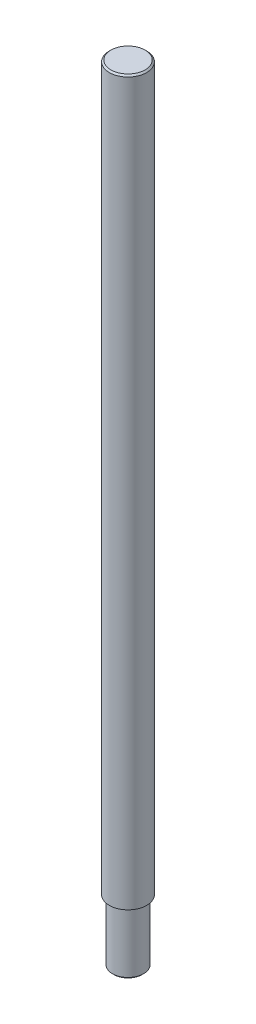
ISO-10303-21;
HEADER;
FILE_DESCRIPTION(('STEP AP214'),'2;1');
FILE_NAME('part.step','',(''),(''),'','','');
FILE_SCHEMA(('AUTOMOTIVE_DESIGN { 1 0 10303 214 1 1 1 1 }'));
ENDSEC;
DATA;
#1=APPLICATION_CONTEXT('core data for automotive mechanical design processes');
#2=APPLICATION_PROTOCOL_DEFINITION('international standard','automotive_design',2000,#1);
#3=PRODUCT_CONTEXT('',#1,'mechanical');
#4=PRODUCT('Part','Part','',(#3));
#5=PRODUCT_RELATED_PRODUCT_CATEGORY('part','',(#4));
#6=PRODUCT_DEFINITION_FORMATION('','',#4);
#7=PRODUCT_DEFINITION_CONTEXT('part definition',#1,'design');
#8=PRODUCT_DEFINITION('design','',#6,#7);
#9=PRODUCT_DEFINITION_SHAPE('','',#8);
#10=(LENGTH_UNIT() NAMED_UNIT(*) SI_UNIT(.MILLI.,.METRE.));
#11=(NAMED_UNIT(*) PLANE_ANGLE_UNIT() SI_UNIT($,.RADIAN.));
#12=(NAMED_UNIT(*) SI_UNIT($,.STERADIAN.) SOLID_ANGLE_UNIT());
#13=UNCERTAINTY_MEASURE_WITH_UNIT(LENGTH_MEASURE(1.E-05),#10,'distance_accuracy_value','');
#14=(GEOMETRIC_REPRESENTATION_CONTEXT(3) GLOBAL_UNCERTAINTY_ASSIGNED_CONTEXT((#13)) GLOBAL_UNIT_ASSIGNED_CONTEXT((#10,
#11,#12)) REPRESENTATION_CONTEXT('',''));
#15=CARTESIAN_POINT('',(0.,0.,0.));
#16=DIRECTION('',(0.,0.,1.));
#17=DIRECTION('',(1.,0.,0.));
#18=AXIS2_PLACEMENT_3D('',#15,#16,#17);
#19=CARTESIAN_POINT('',(0.,-10.,0.));
#20=DIRECTION('',(0.,1.,0.));
#21=DIRECTION('',(0.,0.,1.));
#22=AXIS2_PLACEMENT_3D('',#19,#20,#21);
#23=CYLINDRICAL_SURFACE('',#22,2.5);
#24=CARTESIAN_POINT('',(0.,-9.75,0.));
#25=DIRECTION('',(0.,1.,0.));
#26=DIRECTION('',(0.,0.,1.));
#27=AXIS2_PLACEMENT_3D('',#24,#25,#26);
#28=CIRCLE('',#27,2.5);
#29=CARTESIAN_POINT('',(0.,-9.75,2.5));
#30=VERTEX_POINT('',#29);
#31=EDGE_CURVE('E9178',#30,#30,#28,.T.);
#32=ORIENTED_EDGE('',*,*,#31,.T.);
#33=EDGE_LOOP('',(#32));
#34=FACE_BOUND('',#33,.T.);
#35=CARTESIAN_POINT('',(0.,0.,0.));
#36=DIRECTION('',(0.,1.,0.));
#37=DIRECTION('',(0.,0.,1.));
#38=AXIS2_PLACEMENT_3D('',#35,#36,#37);
#39=CIRCLE('',#38,2.5);
#40=CARTESIAN_POINT('',(0.,0.,2.5));
#41=VERTEX_POINT('',#40);
#42=EDGE_CURVE('E9191',#41,#41,#39,.T.);
#43=ORIENTED_EDGE('',*,*,#42,.F.);
#44=EDGE_LOOP('',(#43));
#45=FACE_BOUND('',#44,.T.);
#46=ADVANCED_FACE('F9172',(#34,#45),#23,.T.);
#47=CARTESIAN_POINT('',(0.,-10.,0.));
#48=DIRECTION('',(0.,1.,0.));
#49=DIRECTION('',(0.,0.,1.));
#50=AXIS2_PLACEMENT_3D('',#47,#48,#49);
#51=PLANE('',#50);
#52=CARTESIAN_POINT('',(0.,-10.,0.));
#53=DIRECTION('',(0.,1.,0.));
#54=DIRECTION('',(0.,0.,1.));
#55=AXIS2_PLACEMENT_3D('',#52,#53,#54);
#56=CIRCLE('',#55,2.25);
#57=CARTESIAN_POINT('',(0.,-10.,2.25));
#58=VERTEX_POINT('',#57);
#59=EDGE_CURVE('E10',#58,#58,#56,.F.);
#60=ORIENTED_EDGE('',*,*,#59,.T.);
#61=EDGE_LOOP('',(#60));
#62=FACE_BOUND('',#61,.T.);
#63=ADVANCED_FACE('F9217',(#62),#51,.F.);
#64=CARTESIAN_POINT('',(0.,116.,0.));
#65=DIRECTION('',(0.,-1.,0.));
#66=DIRECTION('',(0.,0.,-1.));
#67=AXIS2_PLACEMENT_3D('',#64,#65,#66);
#68=CYLINDRICAL_SURFACE('',#67,3.);
#69=CARTESIAN_POINT('',(0.,115.75,0.));
#70=DIRECTION('',(0.,1.,0.));
#71=DIRECTION('',(0.,0.,1.));
#72=AXIS2_PLACEMENT_3D('',#69,#70,#71);
#73=CIRCLE('',#72,3.);
#74=CARTESIAN_POINT('',(0.,115.75,-3.));
#75=VERTEX_POINT('',#74);
#76=EDGE_CURVE('E9182',#75,#75,#73,.F.);
#77=CARTESIAN_POINT('',(0.,0.,0.));
#78=DIRECTION('',(0.,1.,0.));
#79=DIRECTION('',(0.,0.,1.));
#80=AXIS2_PLACEMENT_3D('',#77,#78,#79);
#81=CIRCLE('',#80,3.);
#82=CARTESIAN_POINT('',(0.,0.,-3.));
#83=VERTEX_POINT('',#82);
#84=EDGE_CURVE('E9194',#83,#83,#81,.T.);
#85=CARTESIAN_POINT('',(0.,115.75,-3.));
#86=CARTESIAN_POINT('',(0.,114.544270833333,-3.));
#87=CARTESIAN_POINT('',(0.,113.338541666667,-3.));
#88=CARTESIAN_POINT('',(0.,110.927083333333,-3.));
#89=CARTESIAN_POINT('',(0.,109.721354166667,-3.));
#90=CARTESIAN_POINT('',(0.,107.309895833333,-3.));
#91=CARTESIAN_POINT('',(0.,106.104166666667,-3.));
#92=CARTESIAN_POINT('',(0.,103.692708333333,-3.));
#93=CARTESIAN_POINT('',(0.,102.486979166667,-3.));
#94=CARTESIAN_POINT('',(0.,100.075520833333,-3.));
#95=CARTESIAN_POINT('',(0.,98.8697916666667,-3.));
#96=CARTESIAN_POINT('',(0.,96.4583333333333,-3.));
#97=CARTESIAN_POINT('',(0.,95.2526041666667,-3.));
#98=CARTESIAN_POINT('',(0.,92.8411458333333,-3.));
#99=CARTESIAN_POINT('',(0.,91.6354166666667,-3.));
#100=CARTESIAN_POINT('',(0.,89.2239583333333,-3.));
#101=CARTESIAN_POINT('',(0.,88.0182291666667,-3.));
#102=CARTESIAN_POINT('',(0.,85.6067708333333,-3.));
#103=CARTESIAN_POINT('',(0.,84.4010416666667,-3.));
#104=CARTESIAN_POINT('',(0.,81.9895833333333,-3.));
#105=CARTESIAN_POINT('',(0.,80.7838541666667,-3.));
#106=CARTESIAN_POINT('',(0.,78.3723958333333,-3.));
#107=CARTESIAN_POINT('',(0.,77.1666666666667,-3.));
#108=CARTESIAN_POINT('',(0.,74.7552083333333,-3.));
#109=CARTESIAN_POINT('',(0.,73.5494791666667,-3.));
#110=CARTESIAN_POINT('',(0.,71.1380208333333,-3.));
#111=CARTESIAN_POINT('',(0.,69.9322916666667,-3.));
#112=CARTESIAN_POINT('',(0.,67.5208333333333,-3.));
#113=CARTESIAN_POINT('',(0.,66.3151041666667,-3.));
#114=CARTESIAN_POINT('',(0.,63.9036458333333,-3.));
#115=CARTESIAN_POINT('',(0.,62.6979166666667,-3.));
#116=CARTESIAN_POINT('',(0.,60.2864583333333,-3.));
#117=CARTESIAN_POINT('',(0.,59.0807291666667,-3.));
#118=CARTESIAN_POINT('',(0.,56.6692708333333,-3.));
#119=CARTESIAN_POINT('',(0.,55.4635416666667,-3.));
#120=CARTESIAN_POINT('',(0.,53.0520833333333,-3.));
#121=CARTESIAN_POINT('',(0.,51.8463541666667,-3.));
#122=CARTESIAN_POINT('',(0.,49.4348958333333,-3.));
#123=CARTESIAN_POINT('',(0.,48.2291666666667,-3.));
#124=CARTESIAN_POINT('',(0.,45.8177083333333,-3.));
#125=CARTESIAN_POINT('',(0.,44.6119791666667,-3.));
#126=CARTESIAN_POINT('',(0.,42.2005208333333,-3.));
#127=CARTESIAN_POINT('',(0.,40.9947916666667,-3.));
#128=CARTESIAN_POINT('',(0.,38.5833333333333,-3.));
#129=CARTESIAN_POINT('',(0.,37.3776041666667,-3.));
#130=CARTESIAN_POINT('',(0.,34.9661458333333,-3.));
#131=CARTESIAN_POINT('',(0.,33.7604166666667,-3.));
#132=CARTESIAN_POINT('',(0.,31.3489583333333,-3.));
#133=CARTESIAN_POINT('',(0.,30.1432291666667,-3.));
#134=CARTESIAN_POINT('',(0.,27.7317708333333,-3.));
#135=CARTESIAN_POINT('',(0.,26.5260416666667,-3.));
#136=CARTESIAN_POINT('',(0.,24.1145833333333,-3.));
#137=CARTESIAN_POINT('',(0.,22.9088541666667,-3.));
#138=CARTESIAN_POINT('',(0.,20.4973958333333,-3.));
#139=CARTESIAN_POINT('',(0.,19.2916666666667,-3.));
#140=CARTESIAN_POINT('',(0.,16.8802083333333,-3.));
#141=CARTESIAN_POINT('',(0.,15.6744791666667,-3.));
#142=CARTESIAN_POINT('',(0.,13.2630208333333,-3.));
#143=CARTESIAN_POINT('',(0.,12.0572916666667,-3.));
#144=CARTESIAN_POINT('',(0.,9.64583333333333,-3.));
#145=CARTESIAN_POINT('',(0.,8.44010416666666,-3.));
#146=CARTESIAN_POINT('',(0.,6.02864583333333,-3.));
#147=CARTESIAN_POINT('',(0.,4.82291666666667,-3.));
#148=CARTESIAN_POINT('',(0.,2.41145833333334,-3.));
#149=CARTESIAN_POINT('',(0.,1.20572916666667,-3.));
#150=CARTESIAN_POINT('',(0.,0.,-3.));
#151=B_SPLINE_CURVE_WITH_KNOTS('',3,(#85,#86,#87,#88,#89,#90,#91,#92,#93,#94,#95,#96,#97,#98,
#99,#100,#101,#102,#103,#104,#105,#106,#107,#108,#109,#110,#111,#112,#113,#114,#115,#116,#117,
#118,#119,#120,#121,#122,#123,#124,#125,#126,#127,#128,#129,#130,#131,#132,#133,#134,#135,#136,
#137,#138,#139,#140,#141,#142,#143,#144,#145,#146,#147,#148,#149,#150),.UNSPECIFIED.,.F.,.F.,(4,
2,2,2,2,2,2,2,2,2,2,2,2,2,2,2,2,2,2,2,2,2,2,2,2,2,2,2,2,2,2,2,4),(0.,3.61718750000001,7.234375,
10.8515625,14.46875,18.0859375,21.703125,25.3203125,28.9375,32.5546875,36.171875,39.7890625,
43.40625,47.0234375,50.640625,54.2578125,57.875,61.4921875,65.109375,68.7265625,72.34375,
75.9609375,79.578125,83.1953125,86.8125,90.4296875,94.046875,97.6640625,101.28125,104.8984375,
108.515625,112.1328125,115.75),.UNSPECIFIED.);
#152=EDGE_CURVE('BSEAM9198',#75,#83,#151,.T.);
#153=ORIENTED_EDGE('',*,*,#76,.T.);
#154=ORIENTED_EDGE('',*,*,#84,.T.);
#155=ORIENTED_EDGE('',*,*,#152,.T.);
#156=ORIENTED_EDGE('',*,*,#152,.F.);
#157=EDGE_LOOP('',(#153,#155,#154,#156));
#158=FACE_BOUND('',#157,.T.);
#159=ADVANCED_FACE('F9198',(#158),#68,.T.);
#160=CARTESIAN_POINT('',(0.,116.,0.));
#161=DIRECTION('',(0.,1.,0.));
#162=DIRECTION('',(0.,0.,1.));
#163=AXIS2_PLACEMENT_3D('',#160,#161,#162);
#164=PLANE('',#163);
#165=CARTESIAN_POINT('',(0.,116.,0.));
#166=DIRECTION('',(0.,1.,0.));
#167=DIRECTION('',(0.,0.,1.));
#168=AXIS2_PLACEMENT_3D('',#165,#166,#167);
#169=CIRCLE('',#168,2.75);
#170=CARTESIAN_POINT('',(0.,116.,2.75));
#171=VERTEX_POINT('',#170);
#172=EDGE_CURVE('E9186',#171,#171,#169,.T.);
#173=ORIENTED_EDGE('',*,*,#172,.T.);
#174=EDGE_LOOP('',(#173));
#175=FACE_BOUND('',#174,.T.);
#176=ADVANCED_FACE('F9203',(#175),#164,.T.);
#177=CARTESIAN_POINT('',(0.,0.,0.));
#178=DIRECTION('',(0.,1.,0.));
#179=DIRECTION('',(0.,0.,1.));
#180=AXIS2_PLACEMENT_3D('',#177,#178,#179);
#181=PLANE('',#180);
#182=ORIENTED_EDGE('',*,*,#42,.T.);
#183=EDGE_LOOP('',(#182));
#184=FACE_BOUND('',#183,.T.);
#185=ORIENTED_EDGE('',*,*,#84,.F.);
#186=EDGE_LOOP('',(#185));
#187=FACE_BOUND('',#186,.T.);
#188=ADVANCED_FACE('F9200',(#184,#187),#181,.F.);
#189=CARTESIAN_POINT('',(0.,116.,0.));
#190=DIRECTION('',(0.,-1.,0.));
#191=DIRECTION('',(0.,0.,-1.));
#192=AXIS2_PLACEMENT_3D('',#189,#190,#191);
#193=CONICAL_SURFACE('',#192,2.75,0.785398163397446);
#194=ORIENTED_EDGE('',*,*,#76,.F.);
#195=EDGE_LOOP('',(#194));
#196=FACE_BOUND('',#195,.T.);
#197=ORIENTED_EDGE('',*,*,#172,.F.);
#198=EDGE_LOOP('',(#197));
#199=FACE_BOUND('',#198,.T.);
#200=ADVANCED_FACE('F9202',(#196,#199),#193,.T.);
#201=CARTESIAN_POINT('',(0.,-9.75,0.));
#202=DIRECTION('',(0.,1.,0.));
#203=DIRECTION('',(0.,0.,1.));
#204=AXIS2_PLACEMENT_3D('',#201,#202,#203);
#205=CONICAL_SURFACE('',#204,2.5,0.785398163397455);
#206=ORIENTED_EDGE('',*,*,#59,.F.);
#207=EDGE_LOOP('',(#206));
#208=FACE_BOUND('',#207,.T.);
#209=ORIENTED_EDGE('',*,*,#31,.F.);
#210=EDGE_LOOP('',(#209));
#211=FACE_BOUND('',#210,.T.);
#212=ADVANCED_FACE('F9210',(#208,#211),#205,.T.);
#213=CLOSED_SHELL('',(#46,#63,#159,#176,#188,#200,#212));
#214=MANIFOLD_SOLID_BREP('B2',#213);
#215=ADVANCED_BREP_SHAPE_REPRESENTATION('',(#18,#214),#14);
#216=SHAPE_DEFINITION_REPRESENTATION(#9,#215);
ENDSEC;
END-ISO-10303-21;
